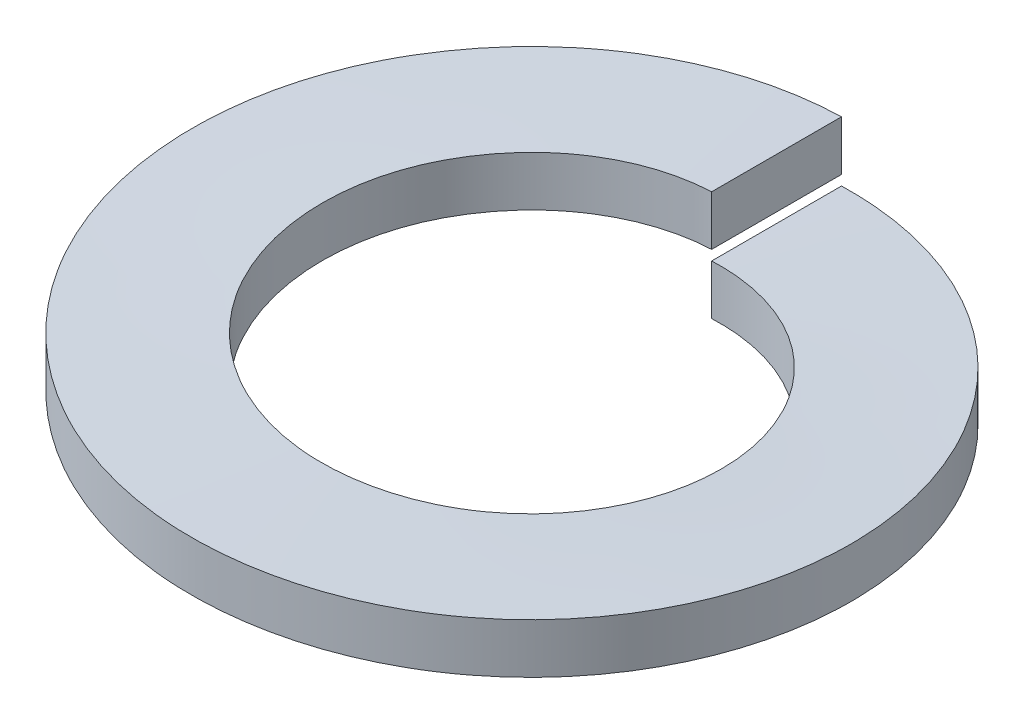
ISO-10303-21;
HEADER;
FILE_DESCRIPTION(('STEP AP214'),'2;1');
FILE_NAME('part.step','',(''),(''),'','','');
FILE_SCHEMA(('AUTOMOTIVE_DESIGN { 1 0 10303 214 1 1 1 1 }'));
ENDSEC;
DATA;
#1=APPLICATION_CONTEXT('core data for automotive mechanical design processes');
#2=APPLICATION_PROTOCOL_DEFINITION('international standard','automotive_design',2000,#1);
#3=PRODUCT_CONTEXT('',#1,'mechanical');
#4=PRODUCT('Part','Part','',(#3));
#5=PRODUCT_RELATED_PRODUCT_CATEGORY('part','',(#4));
#6=PRODUCT_DEFINITION_FORMATION('','',#4);
#7=PRODUCT_DEFINITION_CONTEXT('part definition',#1,'design');
#8=PRODUCT_DEFINITION('design','',#6,#7);
#9=PRODUCT_DEFINITION_SHAPE('','',#8);
#10=(LENGTH_UNIT() NAMED_UNIT(*) SI_UNIT(.MILLI.,.METRE.));
#11=(NAMED_UNIT(*) PLANE_ANGLE_UNIT() SI_UNIT($,.RADIAN.));
#12=(NAMED_UNIT(*) SI_UNIT($,.STERADIAN.) SOLID_ANGLE_UNIT());
#13=UNCERTAINTY_MEASURE_WITH_UNIT(LENGTH_MEASURE(1.E-05),#10,'distance_accuracy_value','');
#14=(GEOMETRIC_REPRESENTATION_CONTEXT(3) GLOBAL_UNCERTAINTY_ASSIGNED_CONTEXT((#13)) GLOBAL_UNIT_ASSIGNED_CONTEXT((#10,
#11,#12)) REPRESENTATION_CONTEXT('',''));
#15=CARTESIAN_POINT('',(0.,0.,0.));
#16=DIRECTION('',(0.,0.,1.));
#17=DIRECTION('',(1.,0.,0.));
#18=AXIS2_PLACEMENT_3D('',#15,#16,#17);
#19=CARTESIAN_POINT('',(0.,0.35,-2.));
#20=DIRECTION('',(1.,0.,0.));
#21=DIRECTION('',(0.,0.,-1.));
#22=AXIS2_PLACEMENT_3D('',#19,#20,#21);
#23=PLANE('',#22);
#24=DIRECTION('',(0.,-1.,0.));
#25=VECTOR('',#24,1.);
#26=CARTESIAN_POINT('',(0.,0.85,-2.));
#27=LINE('',#26,#25);
#28=CARTESIAN_POINT('',(0.,0.85,-2.));
#29=VERTEX_POINT('',#28);
#30=CARTESIAN_POINT('',(0.,0.35,-2.));
#31=VERTEX_POINT('',#30);
#32=EDGE_CURVE('E83',#29,#31,#27,.T.);
#33=ORIENTED_EDGE('',*,*,#32,.T.);
#34=DIRECTION('',(0.,0.,-1.));
#35=VECTOR('',#34,1.);
#36=CARTESIAN_POINT('',(0.,0.35,-2.));
#37=LINE('',#36,#35);
#38=CARTESIAN_POINT('',(0.,0.35,-3.3));
#39=VERTEX_POINT('',#38);
#40=EDGE_CURVE('E76',#31,#39,#37,.T.);
#41=ORIENTED_EDGE('',*,*,#40,.T.);
#42=DIRECTION('',(0.,1.,0.));
#43=VECTOR('',#42,1.);
#44=CARTESIAN_POINT('',(0.,0.85,-3.3));
#45=LINE('',#44,#43);
#46=CARTESIAN_POINT('',(0.,0.85,-3.3));
#47=VERTEX_POINT('',#46);
#48=EDGE_CURVE('E71',#39,#47,#45,.T.);
#49=ORIENTED_EDGE('',*,*,#48,.T.);
#50=DIRECTION('',(0.,0.,1.));
#51=VECTOR('',#50,1.);
#52=CARTESIAN_POINT('',(0.,0.85,-2.));
#53=LINE('',#52,#51);
#54=EDGE_CURVE('E66',#47,#29,#53,.T.);
#55=ORIENTED_EDGE('',*,*,#54,.T.);
#56=EDGE_LOOP('',(#33,#41,#49,#55));
#57=FACE_BOUND('',#56,.T.);
#58=ADVANCED_FACE('F31',(#57),#23,.T.);
#59=CARTESIAN_POINT('',(0.,-0.25,-2.));
#60=DIRECTION('',(1.,0.,0.));
#61=DIRECTION('',(0.,0.,-1.));
#62=AXIS2_PLACEMENT_3D('',#59,#60,#61);
#63=PLANE('',#62);
#64=DIRECTION('',(0.,-1.,0.));
#65=VECTOR('',#64,1.);
#66=CARTESIAN_POINT('',(0.,0.25,-2.));
#67=LINE('',#66,#65);
#68=CARTESIAN_POINT('',(0.,0.25,-2.));
#69=VERTEX_POINT('',#68);
#70=CARTESIAN_POINT('',(0.,-0.25,-2.));
#71=VERTEX_POINT('',#70);
#72=EDGE_CURVE('E91',#69,#71,#67,.T.);
#73=ORIENTED_EDGE('',*,*,#72,.F.);
#74=DIRECTION('',(0.,0.,1.));
#75=VECTOR('',#74,1.);
#76=CARTESIAN_POINT('',(0.,0.25,-2.));
#77=LINE('',#76,#75);
#78=CARTESIAN_POINT('',(0.,0.25,-3.3));
#79=VERTEX_POINT('',#78);
#80=EDGE_CURVE('E11',#79,#69,#77,.T.);
#81=ORIENTED_EDGE('',*,*,#80,.F.);
#82=DIRECTION('',(0.,1.,0.));
#83=VECTOR('',#82,1.);
#84=CARTESIAN_POINT('',(0.,0.25,-3.3));
#85=LINE('',#84,#83);
#86=CARTESIAN_POINT('',(0.,-0.25,-3.3));
#87=VERTEX_POINT('',#86);
#88=EDGE_CURVE('E45',#87,#79,#85,.T.);
#89=ORIENTED_EDGE('',*,*,#88,.F.);
#90=DIRECTION('',(0.,0.,-1.));
#91=VECTOR('',#90,1.);
#92=CARTESIAN_POINT('',(0.,-0.25,-2.));
#93=LINE('',#92,#91);
#94=EDGE_CURVE('E54',#71,#87,#93,.T.);
#95=ORIENTED_EDGE('',*,*,#94,.F.);
#96=EDGE_LOOP('',(#73,#81,#89,#95));
#97=FACE_BOUND('',#96,.T.);
#98=ADVANCED_FACE('F137',(#97),#63,.F.);
#99=CARTESIAN_POINT('',(0.,0.,0.));
#100=DIRECTION('',(0.,-1.,0.));
#101=DIRECTION('',(0.,0.,-1.));
#102=AXIS2_PLACEMENT_3D('',#99,#100,#101);
#103=CYLINDRICAL_SURFACE('',#102,2.);
#104=CARTESIAN_POINT('',(0.,0.35,-2.));
#105=CARTESIAN_POINT('',(-1.15470053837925,0.3,-2.));
#106=CARTESIAN_POINT('',(-1.73205080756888,0.25,-1.));
#107=CARTESIAN_POINT('',(-2.3094010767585,0.2,0.));
#108=CARTESIAN_POINT('',(-1.73205080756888,0.15,1.));
#109=CARTESIAN_POINT('',(-1.15470053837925,0.1,2.));
#110=CARTESIAN_POINT('',(0.,0.0500000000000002,2.));
#111=CARTESIAN_POINT('',(1.15470053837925,0.,2.));
#112=CARTESIAN_POINT('',(1.73205080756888,-0.0499999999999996,1.));
#113=CARTESIAN_POINT('',(2.3094010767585,-0.0999999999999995,0.));
#114=CARTESIAN_POINT('',(1.73205080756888,-0.149999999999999,-0.999999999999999));
#115=CARTESIAN_POINT('',(1.15470053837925,-0.199999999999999,-2.));
#116=CARTESIAN_POINT('',(0.,-0.249999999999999,-2.));
#117=(BOUNDED_CURVE() B_SPLINE_CURVE(2,(#104,#105,#106,#107,#108,#109,#110,#111,#112,#113,#114,
#115,#116),.UNSPECIFIED.,.F.,.F.) B_SPLINE_CURVE_WITH_KNOTS((3,2,2,2,2,2,3),(0.,
0.166666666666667,0.333333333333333,0.5,0.666666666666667,0.833333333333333,1.),
.UNSPECIFIED.) CURVE() GEOMETRIC_REPRESENTATION_ITEM() RATIONAL_B_SPLINE_CURVE((1.,
0.866025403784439,1.,0.866025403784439,1.,0.866025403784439,1.,0.866025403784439,1.,
0.866025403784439,1.,0.866025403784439,1.)) REPRESENTATION_ITEM(''));
#118=EDGE_CURVE('E86',#31,#71,#117,.T.);
#119=ORIENTED_EDGE('',*,*,#118,.F.);
#120=ORIENTED_EDGE('',*,*,#32,.F.);
#121=CARTESIAN_POINT('',(0.,0.85,-2.));
#122=CARTESIAN_POINT('',(-1.15470053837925,0.8,-2.));
#123=CARTESIAN_POINT('',(-1.73205080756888,0.75,-1.));
#124=CARTESIAN_POINT('',(-2.3094010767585,0.7,0.));
#125=CARTESIAN_POINT('',(-1.73205080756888,0.65,0.999999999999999));
#126=CARTESIAN_POINT('',(-1.15470053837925,0.6,2.));
#127=CARTESIAN_POINT('',(0.,0.55,2.));
#128=CARTESIAN_POINT('',(1.15470053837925,0.5,2.));
#129=CARTESIAN_POINT('',(1.73205080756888,0.45,1.));
#130=CARTESIAN_POINT('',(2.3094010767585,0.400000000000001,0.));
#131=CARTESIAN_POINT('',(1.73205080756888,0.350000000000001,-0.999999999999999));
#132=CARTESIAN_POINT('',(1.15470053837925,0.300000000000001,-2.));
#133=CARTESIAN_POINT('',(0.,0.250000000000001,-2.));
#134=(BOUNDED_CURVE() B_SPLINE_CURVE(2,(#121,#122,#123,#124,#125,#126,#127,#128,#129,#130,#131,
#132,#133),.UNSPECIFIED.,.F.,.F.) B_SPLINE_CURVE_WITH_KNOTS((3,2,2,2,2,2,3),(0.,
0.166666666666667,0.333333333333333,0.5,0.666666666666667,0.833333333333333,1.),
.UNSPECIFIED.) CURVE() GEOMETRIC_REPRESENTATION_ITEM() RATIONAL_B_SPLINE_CURVE((1.,
0.866025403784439,1.,0.866025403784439,1.,0.866025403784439,1.,0.866025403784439,1.,
0.866025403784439,1.,0.866025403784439,1.)) REPRESENTATION_ITEM(''));
#135=EDGE_CURVE('E85',#29,#69,#134,.T.);
#136=ORIENTED_EDGE('',*,*,#135,.T.);
#137=ORIENTED_EDGE('',*,*,#72,.T.);
#138=EDGE_LOOP('',(#119,#120,#136,#137));
#139=FACE_BOUND('',#138,.T.);
#140=ADVANCED_FACE('F84',(#139),#103,.F.);
#141=CARTESIAN_POINT('',(0.,0.35,-2.));
#142=CARTESIAN_POINT('',(-1.15470053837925,0.3,-2.));
#143=CARTESIAN_POINT('',(-1.73205080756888,0.25,-1.));
#144=CARTESIAN_POINT('',(-2.3094010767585,0.2,0.));
#145=CARTESIAN_POINT('',(-1.73205080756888,0.15,1.));
#146=CARTESIAN_POINT('',(-1.15470053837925,0.1,2.));
#147=CARTESIAN_POINT('',(0.,0.0500000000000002,2.));
#148=CARTESIAN_POINT('',(1.15470053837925,0.,2.));
#149=CARTESIAN_POINT('',(1.73205080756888,-0.0499999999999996,1.));
#150=CARTESIAN_POINT('',(2.3094010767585,-0.0999999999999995,0.));
#151=CARTESIAN_POINT('',(1.73205080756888,-0.149999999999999,-0.999999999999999));
#152=CARTESIAN_POINT('',(1.15470053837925,-0.199999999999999,-2.));
#153=CARTESIAN_POINT('',(0.,-0.249999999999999,-2.));
#154=CARTESIAN_POINT('',(0.,0.35,-3.3));
#155=CARTESIAN_POINT('',(-1.90525588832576,0.3,-3.3));
#156=CARTESIAN_POINT('',(-2.85788383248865,0.25,-1.65));
#157=CARTESIAN_POINT('',(-3.81051177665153,0.2,0.));
#158=CARTESIAN_POINT('',(-2.85788383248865,0.15,1.65));
#159=CARTESIAN_POINT('',(-1.90525588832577,0.1,3.3));
#160=CARTESIAN_POINT('',(0.,0.0500000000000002,3.3));
#161=CARTESIAN_POINT('',(1.90525588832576,0.,3.3));
#162=CARTESIAN_POINT('',(2.85788383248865,-0.0499999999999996,1.65));
#163=CARTESIAN_POINT('',(3.81051177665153,-0.0999999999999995,0.));
#164=CARTESIAN_POINT('',(2.85788383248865,-0.149999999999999,-1.65));
#165=CARTESIAN_POINT('',(1.90525588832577,-0.199999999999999,-3.3));
#166=CARTESIAN_POINT('',(0.,-0.249999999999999,-3.3));
#167=(BOUNDED_SURFACE() B_SPLINE_SURFACE(1,2,((#141,#142,#143,#144,#145,#146,#147,#148,#149,
#150,#151,#152,#153),(#154,#155,#156,#157,#158,#159,#160,#161,#162,#163,#164,#165,#166)),
.UNSPECIFIED.,.F.,.F.,.F.) B_SPLINE_SURFACE_WITH_KNOTS((2,2),(3,2,2,2,2,2,3),(0.,1.),(0.,
0.166666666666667,0.333333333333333,0.5,0.666666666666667,0.833333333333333,1.),
.UNSPECIFIED.) GEOMETRIC_REPRESENTATION_ITEM() RATIONAL_B_SPLINE_SURFACE(((1.,0.866025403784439,
1.,0.866025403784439,1.,0.866025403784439,1.,0.866025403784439,1.,0.866025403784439,1.,
0.866025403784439,1.),(1.,0.866025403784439,1.,0.866025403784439,1.,0.866025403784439,1.,
0.866025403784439,1.,0.866025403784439,1.,0.866025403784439,1.))) REPRESENTATION_ITEM('') SURFACE());
#168=CARTESIAN_POINT('',(0.,0.35,-3.3));
#169=CARTESIAN_POINT('',(-1.90525588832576,0.3,-3.3));
#170=CARTESIAN_POINT('',(-2.85788383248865,0.25,-1.65));
#171=CARTESIAN_POINT('',(-3.81051177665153,0.2,0.));
#172=CARTESIAN_POINT('',(-2.85788383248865,0.15,1.65));
#173=CARTESIAN_POINT('',(-1.90525588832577,0.1,3.3));
#174=CARTESIAN_POINT('',(0.,0.0500000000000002,3.3));
#175=CARTESIAN_POINT('',(1.90525588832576,0.,3.3));
#176=CARTESIAN_POINT('',(2.85788383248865,-0.0499999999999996,1.65));
#177=CARTESIAN_POINT('',(3.81051177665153,-0.0999999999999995,0.));
#178=CARTESIAN_POINT('',(2.85788383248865,-0.149999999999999,-1.65));
#179=CARTESIAN_POINT('',(1.90525588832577,-0.199999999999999,-3.3));
#180=CARTESIAN_POINT('',(0.,-0.249999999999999,-3.3));
#181=(BOUNDED_CURVE() B_SPLINE_CURVE(2,(#168,#169,#170,#171,#172,#173,#174,#175,#176,#177,#178,
#179,#180),.UNSPECIFIED.,.F.,.F.) B_SPLINE_CURVE_WITH_KNOTS((3,2,2,2,2,2,3),(0.,
0.166666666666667,0.333333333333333,0.5,0.666666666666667,0.833333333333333,1.),
.UNSPECIFIED.) CURVE() GEOMETRIC_REPRESENTATION_ITEM() RATIONAL_B_SPLINE_CURVE((1.,
0.866025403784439,1.,0.866025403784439,1.,0.866025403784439,1.,0.866025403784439,1.,
0.866025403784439,1.,0.866025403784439,1.)) REPRESENTATION_ITEM(''));
#182=EDGE_CURVE('E106',#39,#87,#181,.T.);
#183=ORIENTED_EDGE('',*,*,#182,.F.);
#184=ORIENTED_EDGE('',*,*,#40,.F.);
#185=ORIENTED_EDGE('',*,*,#118,.T.);
#186=ORIENTED_EDGE('',*,*,#94,.T.);
#187=EDGE_LOOP('',(#183,#184,#185,#186));
#188=FACE_BOUND('',#187,.T.);
#189=ADVANCED_FACE('F124',(#188),#167,.F.);
#190=CARTESIAN_POINT('',(0.,0.,0.));
#191=DIRECTION('',(0.,-1.,0.));
#192=DIRECTION('',(0.,0.,-1.));
#193=AXIS2_PLACEMENT_3D('',#190,#191,#192);
#194=CYLINDRICAL_SURFACE('',#193,3.3);
#195=CARTESIAN_POINT('',(0.,0.85,-3.3));
#196=CARTESIAN_POINT('',(-1.90525588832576,0.8,-3.3));
#197=CARTESIAN_POINT('',(-2.85788383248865,0.75,-1.65));
#198=CARTESIAN_POINT('',(-3.81051177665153,0.7,0.));
#199=CARTESIAN_POINT('',(-2.85788383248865,0.65,1.65));
#200=CARTESIAN_POINT('',(-1.90525588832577,0.6,3.3));
#201=CARTESIAN_POINT('',(0.,0.55,3.3));
#202=CARTESIAN_POINT('',(1.90525588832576,0.5,3.3));
#203=CARTESIAN_POINT('',(2.85788383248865,0.45,1.65));
#204=CARTESIAN_POINT('',(3.81051177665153,0.400000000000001,0.));
#205=CARTESIAN_POINT('',(2.85788383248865,0.350000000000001,-1.65));
#206=CARTESIAN_POINT('',(1.90525588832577,0.300000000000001,-3.3));
#207=CARTESIAN_POINT('',(0.,0.250000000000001,-3.3));
#208=(BOUNDED_CURVE() B_SPLINE_CURVE(2,(#195,#196,#197,#198,#199,#200,#201,#202,#203,#204,#205,
#206,#207),.UNSPECIFIED.,.F.,.F.) B_SPLINE_CURVE_WITH_KNOTS((3,2,2,2,2,2,3),(0.,
0.166666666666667,0.333333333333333,0.5,0.666666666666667,0.833333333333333,1.),
.UNSPECIFIED.) CURVE() GEOMETRIC_REPRESENTATION_ITEM() RATIONAL_B_SPLINE_CURVE((1.,
0.866025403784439,1.,0.866025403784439,1.,0.866025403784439,1.,0.866025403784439,1.,
0.866025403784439,1.,0.866025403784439,1.)) REPRESENTATION_ITEM(''));
#209=EDGE_CURVE('E38',#47,#79,#208,.T.);
#210=ORIENTED_EDGE('',*,*,#209,.F.);
#211=ORIENTED_EDGE('',*,*,#48,.F.);
#212=ORIENTED_EDGE('',*,*,#182,.T.);
#213=ORIENTED_EDGE('',*,*,#88,.T.);
#214=EDGE_LOOP('',(#210,#211,#212,#213));
#215=FACE_BOUND('',#214,.T.);
#216=ADVANCED_FACE('F122',(#215),#194,.T.);
#217=CARTESIAN_POINT('',(0.,0.85,-3.3));
#218=CARTESIAN_POINT('',(-1.90525588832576,0.8,-3.3));
#219=CARTESIAN_POINT('',(-2.85788383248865,0.75,-1.65));
#220=CARTESIAN_POINT('',(-3.81051177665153,0.7,0.));
#221=CARTESIAN_POINT('',(-2.85788383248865,0.65,1.65));
#222=CARTESIAN_POINT('',(-1.90525588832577,0.6,3.3));
#223=CARTESIAN_POINT('',(0.,0.55,3.3));
#224=CARTESIAN_POINT('',(1.90525588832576,0.5,3.3));
#225=CARTESIAN_POINT('',(2.85788383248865,0.45,1.65));
#226=CARTESIAN_POINT('',(3.81051177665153,0.400000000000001,0.));
#227=CARTESIAN_POINT('',(2.85788383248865,0.350000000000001,-1.65));
#228=CARTESIAN_POINT('',(1.90525588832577,0.300000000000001,-3.3));
#229=CARTESIAN_POINT('',(0.,0.250000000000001,-3.3));
#230=CARTESIAN_POINT('',(0.,0.85,-2.));
#231=CARTESIAN_POINT('',(-1.15470053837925,0.8,-2.));
#232=CARTESIAN_POINT('',(-1.73205080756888,0.75,-1.));
#233=CARTESIAN_POINT('',(-2.3094010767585,0.7,0.));
#234=CARTESIAN_POINT('',(-1.73205080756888,0.65,0.999999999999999));
#235=CARTESIAN_POINT('',(-1.15470053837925,0.6,2.));
#236=CARTESIAN_POINT('',(0.,0.55,2.));
#237=CARTESIAN_POINT('',(1.15470053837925,0.5,2.));
#238=CARTESIAN_POINT('',(1.73205080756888,0.45,1.));
#239=CARTESIAN_POINT('',(2.3094010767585,0.400000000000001,0.));
#240=CARTESIAN_POINT('',(1.73205080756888,0.350000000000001,-0.999999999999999));
#241=CARTESIAN_POINT('',(1.15470053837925,0.300000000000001,-2.));
#242=CARTESIAN_POINT('',(0.,0.250000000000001,-2.));
#243=(BOUNDED_SURFACE() B_SPLINE_SURFACE(1,2,((#217,#218,#219,#220,#221,#222,#223,#224,#225,
#226,#227,#228,#229),(#230,#231,#232,#233,#234,#235,#236,#237,#238,#239,#240,#241,#242)),
.UNSPECIFIED.,.F.,.F.,.F.) B_SPLINE_SURFACE_WITH_KNOTS((2,2),(3,2,2,2,2,2,3),(0.,1.),(0.,
0.166666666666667,0.333333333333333,0.5,0.666666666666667,0.833333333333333,1.),
.UNSPECIFIED.) GEOMETRIC_REPRESENTATION_ITEM() RATIONAL_B_SPLINE_SURFACE(((1.,0.866025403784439,
1.,0.866025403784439,1.,0.866025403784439,1.,0.866025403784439,1.,0.866025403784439,1.,
0.866025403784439,1.),(1.,0.866025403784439,1.,0.866025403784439,1.,0.866025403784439,1.,
0.866025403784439,1.,0.866025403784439,1.,0.866025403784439,1.))) REPRESENTATION_ITEM('') SURFACE());
#244=ORIENTED_EDGE('',*,*,#80,.T.);
#245=ORIENTED_EDGE('',*,*,#135,.F.);
#246=ORIENTED_EDGE('',*,*,#54,.F.);
#247=ORIENTED_EDGE('',*,*,#209,.T.);
#248=EDGE_LOOP('',(#244,#245,#246,#247));
#249=FACE_BOUND('',#248,.T.);
#250=ADVANCED_FACE('F89',(#249),#243,.F.);
#251=CLOSED_SHELL('',(#58,#98,#140,#189,#216,#250));
#252=MANIFOLD_SOLID_BREP('B2',#251);
#253=ADVANCED_BREP_SHAPE_REPRESENTATION('',(#18,#252),#14);
#254=SHAPE_DEFINITION_REPRESENTATION(#9,#253);
ENDSEC;
END-ISO-10303-21;
